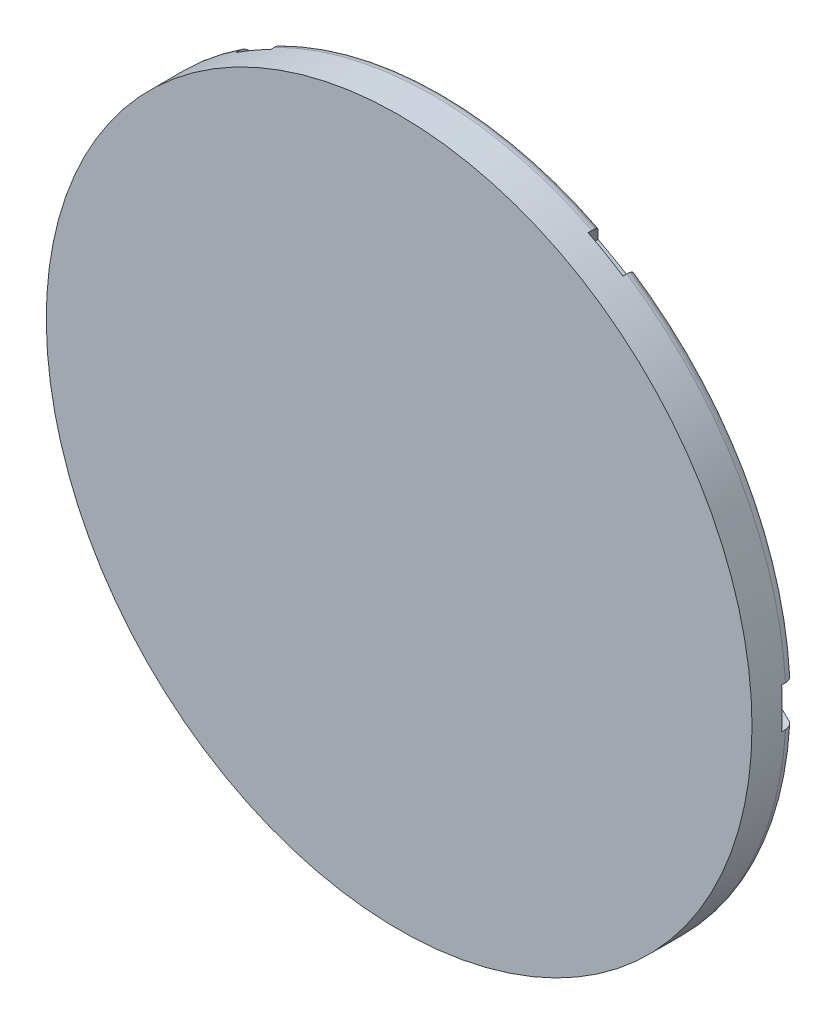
from build123d import *

# Parameters (mm, degrees)
SKETCH1_R           = 17.5
BASE_EXTRUDE_DEPTH  = 2
CHAMFER1_SIZE       = 2
CHAMFER1_SIZE2      = 1
FILLET8_R           = 0.5
SKETCH2_W           = 4
SKETCH2_H           = 2
CUT_EXTRUDE1_DEPTH  = 1.5
CIRPATTERN1_COUNT   = 6
SKETCH3_R           = 17.5
BOSS_EXTRUDE1_DEPTH = 1


with BuildPart() as part:
    # Sketch1 → Base-Extrude (new body)
    with BuildSketch(Plane.XY):
        Circle(SKETCH1_R)
    extrude(amount=BASE_EXTRUDE_DEPTH)

    # Chamfer1
    chamfer1_edges = [part.edges().sort_by_distance(p)[0] for p in [
        (-17.5, 0, 0),
    ]]
    chamfer1_side = [part.faces().sort_by_distance(p)[0] for p in [
        (0, 0, 0),
    ]]
    chamfer(chamfer1_edges, length=CHAMFER1_SIZE, length2=CHAMFER1_SIZE2, reference=chamfer1_side[0])

    # Fillet8
    fillet8_edges = [part.edges().sort_by_distance(p)[0] for p in [
        (-17.5, 0, 1),
        (-15.5, 0, 0),
    ]]
    fillet(fillet8_edges, radius=FILLET8_R)

    # Sketch2 → Cut-Extrude1 (cut)
    with BuildSketch(Plane(origin=(0, 0, 0), x_dir=(-1, 0, 0), z_dir=(0, 0, -1))):
        with Locations((18, 0)):
            Rectangle(SKETCH2_W, SKETCH2_H)
    cut_extrude1 = extrude(amount=-CUT_EXTRUDE1_DEPTH, mode=Mode.SUBTRACT)

    # CirPattern1: Cut-Extrude1 ×6 about axis
    cirpattern1_axis = Axis((0, 0, 0), (0, 0, 1))
    for i in range(1, CIRPATTERN1_COUNT):
        add(cut_extrude1.rotate(cirpattern1_axis, i * 360 / CIRPATTERN1_COUNT), mode=Mode.SUBTRACT)

    # Sketch3 → Boss-Extrude1 (add)
    with BuildSketch(Plane.XY.offset(2)):
        with Locations(Location((0, 0, 0), (0, 0, 176.72417104))):
            Circle(SKETCH3_R)
    extrude(amount=BOSS_EXTRUDE1_DEPTH)


solid = part.part
